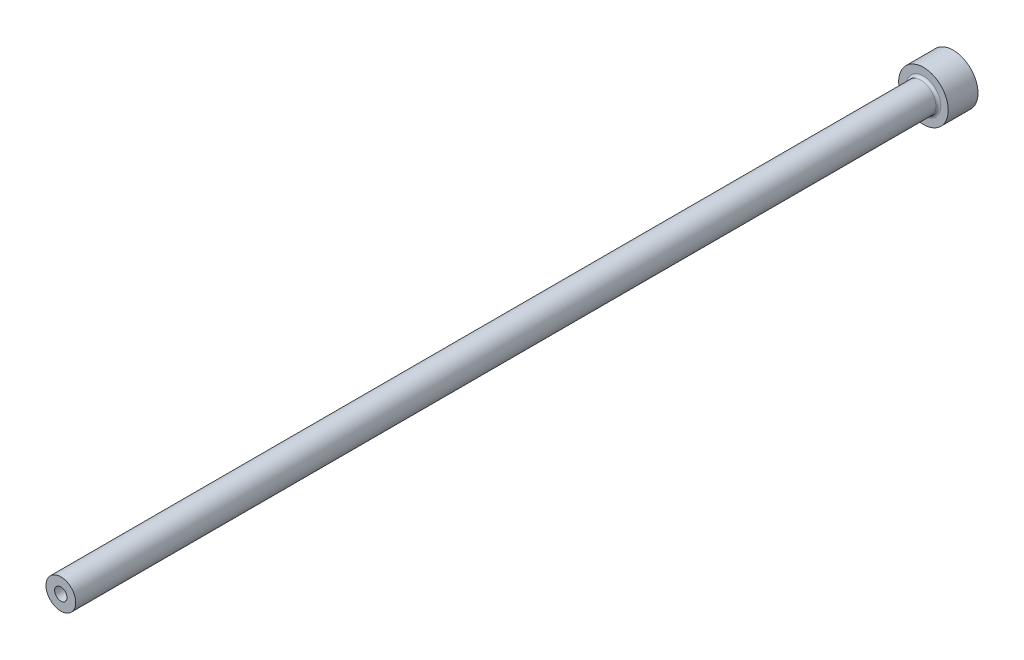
from build123d import *

# Parameters (mm, degrees)
HEAD_FILLET_R          = 0.5
ID_RELIEF_CHAMFER_SIZE = 0.5


with BuildPart() as part:
    # OD FV → Base Revolve (revolve)
    with BuildSketch(Plane(origin=(0, 0, 0), x_dir=(1, 0, 0), z_dir=(0, 1, 0))):
        Polygon((0, -180), (3, -180), (3, -6), (5, -6), (5, 0), (0, 0), align=None)
    revolve(axis=Axis((0, 0, 180), (0, 0, -1)))

    # ID FV → Hole (revolve, cut)
    with BuildSketch(Plane(origin=(0, 0, 0), x_dir=(1, 0, 0), z_dir=(0, 1, 0))):
        Polygon((0, -180), (1.25, -180), (1.25, -105), (1.5, -104.566987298), (1.5, 0), (0, 0), align=None)
    revolve(axis=Axis((0, 0, 180), (0, 0, -1)), mode=Mode.SUBTRACT)

    # Head Fillet
    head_fillet_edges = [part.edges().sort_by_distance(p)[0] for p in [
        (-3, 0, 6),
    ]]
    fillet(head_fillet_edges, radius=HEAD_FILLET_R)

    # ID Relief Chamfer
    id_relief_chamfer_edges = [part.edges().sort_by_distance(p)[0] for p in [
        (-1.5, 0, 0),
    ]]
    chamfer(id_relief_chamfer_edges, length=ID_RELIEF_CHAMFER_SIZE)


solid = part.part
